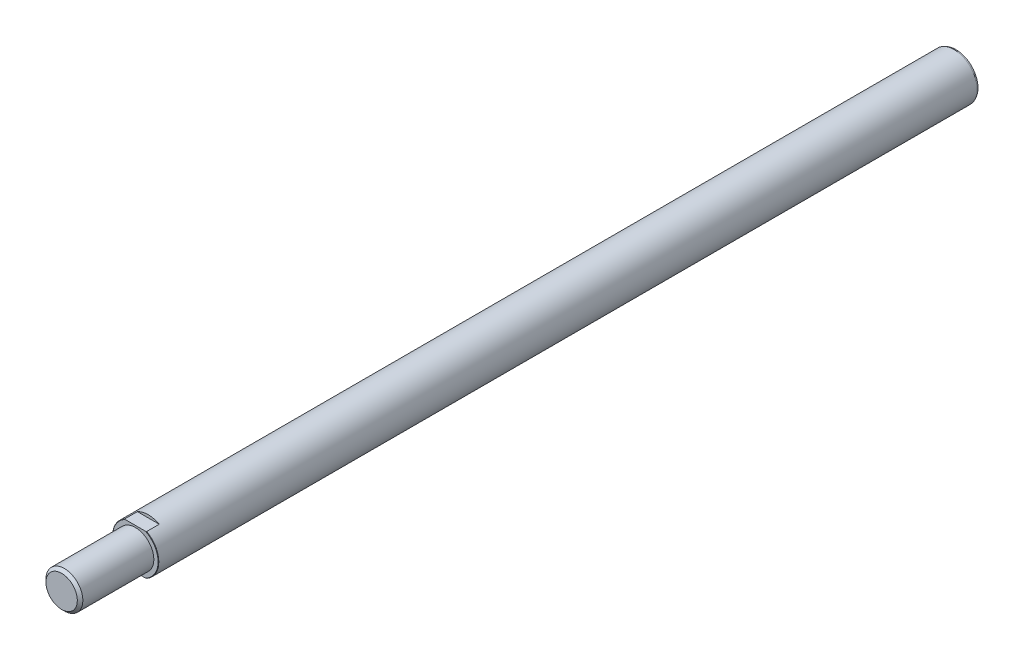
ISO-10303-21;
HEADER;
FILE_DESCRIPTION(('STEP AP214'),'2;1');
FILE_NAME('part.step','',(''),(''),'','','');
FILE_SCHEMA(('AUTOMOTIVE_DESIGN { 1 0 10303 214 1 1 1 1 }'));
ENDSEC;
DATA;
#1=APPLICATION_CONTEXT('core data for automotive mechanical design processes');
#2=APPLICATION_PROTOCOL_DEFINITION('international standard','automotive_design',2000,#1);
#3=PRODUCT_CONTEXT('',#1,'mechanical');
#4=PRODUCT('Part','Part','',(#3));
#5=PRODUCT_RELATED_PRODUCT_CATEGORY('part','',(#4));
#6=PRODUCT_DEFINITION_FORMATION('','',#4);
#7=PRODUCT_DEFINITION_CONTEXT('part definition',#1,'design');
#8=PRODUCT_DEFINITION('design','',#6,#7);
#9=PRODUCT_DEFINITION_SHAPE('','',#8);
#10=(LENGTH_UNIT() NAMED_UNIT(*) SI_UNIT(.MILLI.,.METRE.));
#11=(NAMED_UNIT(*) PLANE_ANGLE_UNIT() SI_UNIT($,.RADIAN.));
#12=(NAMED_UNIT(*) SI_UNIT($,.STERADIAN.) SOLID_ANGLE_UNIT());
#13=UNCERTAINTY_MEASURE_WITH_UNIT(LENGTH_MEASURE(1.E-05),#10,'distance_accuracy_value','');
#14=(GEOMETRIC_REPRESENTATION_CONTEXT(3) GLOBAL_UNCERTAINTY_ASSIGNED_CONTEXT((#13)) GLOBAL_UNIT_ASSIGNED_CONTEXT((#10,
#11,#12)) REPRESENTATION_CONTEXT('',''));
#15=CARTESIAN_POINT('',(0.,0.,0.));
#16=DIRECTION('',(0.,0.,1.));
#17=DIRECTION('',(1.,0.,0.));
#18=AXIS2_PLACEMENT_3D('',#15,#16,#17);
#19=CARTESIAN_POINT('',(0.,0.,485.));
#20=DIRECTION('',(0.,0.,-1.));
#21=DIRECTION('',(-1.,0.,0.));
#22=AXIS2_PLACEMENT_3D('',#19,#20,#21);
#23=CYLINDRICAL_SURFACE('',#22,12.5);
#24=DIRECTION('',(0.,0.,-1.));
#25=VECTOR('',#24,1.);
#26=CARTESIAN_POINT('',(-5.93717104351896,-11.,485.));
#27=LINE('',#26,#25);
#28=CARTESIAN_POINT('',(-5.93717104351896,-11.,444.8));
#29=VERTEX_POINT('',#28);
#30=CARTESIAN_POINT('',(-5.93717104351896,-11.,438.));
#31=VERTEX_POINT('',#30);
#32=EDGE_CURVE('E134',#29,#31,#27,.T.);
#33=ORIENTED_EDGE('',*,*,#32,.F.);
#34=CARTESIAN_POINT('',(0.,0.,444.8));
#35=DIRECTION('',(0.,0.,1.));
#36=DIRECTION('',(1.,0.,0.));
#37=AXIS2_PLACEMENT_3D('',#34,#35,#36);
#38=CIRCLE('',#37,12.5);
#39=CARTESIAN_POINT('',(-5.93717104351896,11.,444.8));
#40=VERTEX_POINT('',#39);
#41=EDGE_CURVE('E146',#29,#40,#38,.F.);
#42=ORIENTED_EDGE('',*,*,#41,.T.);
#43=DIRECTION('',(0.,0.,-1.));
#44=VECTOR('',#43,1.);
#45=CARTESIAN_POINT('',(-5.93717104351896,11.,485.));
#46=LINE('',#45,#44);
#47=CARTESIAN_POINT('',(-5.93717104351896,11.,438.));
#48=VERTEX_POINT('',#47);
#49=EDGE_CURVE('E58',#48,#40,#46,.F.);
#50=ORIENTED_EDGE('',*,*,#49,.F.);
#51=CARTESIAN_POINT('',(0.,0.,438.));
#52=DIRECTION('',(0.,0.,1.));
#53=DIRECTION('',(1.,0.,0.));
#54=AXIS2_PLACEMENT_3D('',#51,#52,#53);
#55=CIRCLE('',#54,12.5);
#56=CARTESIAN_POINT('',(5.93717104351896,11.,438.));
#57=VERTEX_POINT('',#56);
#58=EDGE_CURVE('E329',#57,#48,#55,.T.);
#59=ORIENTED_EDGE('',*,*,#58,.F.);
#60=DIRECTION('',(0.,0.,-1.));
#61=VECTOR('',#60,1.);
#62=CARTESIAN_POINT('',(5.93717104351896,11.,485.));
#63=LINE('',#62,#61);
#64=CARTESIAN_POINT('',(5.93717104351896,11.,444.8));
#65=VERTEX_POINT('',#64);
#66=EDGE_CURVE('E131',#65,#57,#63,.T.);
#67=ORIENTED_EDGE('',*,*,#66,.F.);
#68=CARTESIAN_POINT('',(5.93717104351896,-11.,444.8));
#69=VERTEX_POINT('',#68);
#70=EDGE_CURVE('E143',#65,#69,#38,.F.);
#71=ORIENTED_EDGE('',*,*,#70,.T.);
#72=DIRECTION('',(0.,0.,-1.));
#73=VECTOR('',#72,1.);
#74=CARTESIAN_POINT('',(5.93717104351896,-11.,485.));
#75=LINE('',#74,#73);
#76=CARTESIAN_POINT('',(5.93717104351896,-11.,438.));
#77=VERTEX_POINT('',#76);
#78=EDGE_CURVE('E66',#77,#69,#75,.F.);
#79=ORIENTED_EDGE('',*,*,#78,.F.);
#80=EDGE_CURVE('E332',#31,#77,#55,.T.);
#81=ORIENTED_EDGE('',*,*,#80,.F.);
#82=EDGE_LOOP('',(#33,#42,#50,#59,#67,#71,#79,#81));
#83=FACE_BOUND('',#82,.T.);
#84=CARTESIAN_POINT('',(0.,0.,1.));
#85=DIRECTION('',(0.,0.,-1.));
#86=DIRECTION('',(-1.,0.,0.));
#87=AXIS2_PLACEMENT_3D('',#84,#85,#86);
#88=CIRCLE('',#87,12.5);
#89=CARTESIAN_POINT('',(-12.5,0.,1.));
#90=VERTEX_POINT('',#89);
#91=EDGE_CURVE('E46',#90,#90,#88,.T.);
#92=ORIENTED_EDGE('',*,*,#91,.F.);
#93=EDGE_LOOP('',(#92));
#94=FACE_BOUND('',#93,.T.);
#95=ADVANCED_FACE('F42',(#83,#94),#23,.T.);
#96=CARTESIAN_POINT('',(0.,0.,445.));
#97=DIRECTION('',(0.,0.,1.));
#98=DIRECTION('',(1.,0.,0.));
#99=AXIS2_PLACEMENT_3D('',#96,#97,#98);
#100=PLANE('',#99);
#101=CARTESIAN_POINT('',(0.,0.,445.));
#102=DIRECTION('',(0.,0.,1.));
#103=DIRECTION('',(1.,0.,0.));
#104=AXIS2_PLACEMENT_3D('',#101,#102,#103);
#105=CIRCLE('',#104,10.);
#106=CARTESIAN_POINT('',(10.,0.,445.));
#107=VERTEX_POINT('',#106);
#108=EDGE_CURVE('E136',#107,#107,#105,.T.);
#109=ORIENTED_EDGE('',*,*,#108,.F.);
#110=EDGE_LOOP('',(#109));
#111=FACE_BOUND('',#110,.T.);
#112=CARTESIAN_POINT('',(0.,0.,445.));
#113=DIRECTION('',(0.,0.,1.));
#114=DIRECTION('',(1.,0.,0.));
#115=AXIS2_PLACEMENT_3D('',#112,#113,#114);
#116=CIRCLE('',#115,12.3);
#117=CARTESIAN_POINT('',(-5.50363516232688,11.,445.));
#118=VERTEX_POINT('',#117);
#119=CARTESIAN_POINT('',(-5.50363516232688,-11.,445.));
#120=VERTEX_POINT('',#119);
#121=EDGE_CURVE('E142',#118,#120,#116,.T.);
#122=ORIENTED_EDGE('',*,*,#121,.T.);
#123=DIRECTION('',(1.,0.,0.));
#124=VECTOR('',#123,1.);
#125=CARTESIAN_POINT('',(-18.9676132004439,-11.,445.));
#126=LINE('',#125,#124);
#127=CARTESIAN_POINT('',(5.50363516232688,-11.,445.));
#128=VERTEX_POINT('',#127);
#129=EDGE_CURVE('E123',#120,#128,#126,.T.);
#130=ORIENTED_EDGE('',*,*,#129,.T.);
#131=CARTESIAN_POINT('',(5.50363516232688,11.,445.));
#132=VERTEX_POINT('',#131);
#133=EDGE_CURVE('E139',#128,#132,#116,.T.);
#134=ORIENTED_EDGE('',*,*,#133,.T.);
#135=DIRECTION('',(-1.,0.,0.));
#136=VECTOR('',#135,1.);
#137=CARTESIAN_POINT('',(-18.9676132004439,11.,445.));
#138=LINE('',#137,#136);
#139=EDGE_CURVE('E125',#132,#118,#138,.T.);
#140=ORIENTED_EDGE('',*,*,#139,.T.);
#141=EDGE_LOOP('',(#122,#130,#134,#140));
#142=FACE_BOUND('',#141,.T.);
#143=ADVANCED_FACE('F183',(#111,#142),#100,.T.);
#144=CARTESIAN_POINT('',(0.,0.,445.));
#145=DIRECTION('',(0.,0.,-1.));
#146=DIRECTION('',(-1.,0.,0.));
#147=AXIS2_PLACEMENT_3D('',#144,#145,#146);
#148=CONICAL_SURFACE('',#147,12.3,0.785398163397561);
#149=ORIENTED_EDGE('',*,*,#41,.F.);
#150=CARTESIAN_POINT('',(-25.2049082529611,-11.,429.79932000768));
#151=CARTESIAN_POINT('',(-24.8332961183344,-11.,430.13989947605));
#152=CARTESIAN_POINT('',(-24.4610927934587,-11.,430.479835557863));
#153=CARTESIAN_POINT('',(-23.7153278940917,-11.,431.158220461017));
#154=CARTESIAN_POINT('',(-23.3417663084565,-11.,431.496669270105));
#155=CARTESIAN_POINT('',(-22.5930262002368,-11.,432.1719537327));
#156=CARTESIAN_POINT('',(-22.2178473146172,-11.,432.508788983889));
#157=CARTESIAN_POINT('',(-21.4657494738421,-11.,433.18051046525));
#158=CARTESIAN_POINT('',(-21.0888305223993,-11.,433.515396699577));
#159=CARTESIAN_POINT('',(-20.3305063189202,-11.,434.185120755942));
#160=CARTESIAN_POINT('',(-19.9490878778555,-11.,434.519943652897));
#161=CARTESIAN_POINT('',(-19.1839299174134,-11.,435.186926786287));
#162=CARTESIAN_POINT('',(-18.8001904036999,-11.,435.519087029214));
#163=CARTESIAN_POINT('',(-18.030066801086,-11.,436.180238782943));
#164=CARTESIAN_POINT('',(-17.6436830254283,-11.,436.509230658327));
#165=CARTESIAN_POINT('',(-16.8677829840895,-11.,437.163501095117));
#166=CARTESIAN_POINT('',(-16.478266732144,-11.,437.488779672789));
#167=CARTESIAN_POINT('',(-15.7614675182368,-11.,438.08047512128));
#168=CARTESIAN_POINT('',(-15.4347519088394,-11.,438.347578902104));
#169=CARTESIAN_POINT('',(-14.7783997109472,-11.,438.878171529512));
#170=CARTESIAN_POINT('',(-14.4487631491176,-11.,439.141660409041));
#171=CARTESIAN_POINT('',(-13.7860202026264,-11.,439.664443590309));
#172=CARTESIAN_POINT('',(-13.4529128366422,-11.,439.923736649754));
#173=CARTESIAN_POINT('',(-12.7827870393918,-11.,440.437222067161));
#174=CARTESIAN_POINT('',(-12.4457686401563,-11.,440.691414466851));
#175=CARTESIAN_POINT('',(-11.7675925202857,-11.,441.193346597));
#176=CARTESIAN_POINT('',(-11.4264404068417,-11.,441.441093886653));
#177=CARTESIAN_POINT('',(-10.7388110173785,-11.,441.929138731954));
#178=CARTESIAN_POINT('',(-10.3923335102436,-11.,442.169435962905));
#179=CARTESIAN_POINT('',(-9.69333013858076,-11.,442.640735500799));
#180=CARTESIAN_POINT('',(-9.34080722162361,-11.,442.871742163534));
#181=CARTESIAN_POINT('',(-8.62854944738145,-11.,443.322311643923));
#182=CARTESIAN_POINT('',(-8.26881550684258,-11.,443.541875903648));
#183=CARTESIAN_POINT('',(-7.54622405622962,-11.,443.963558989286));
#184=CARTESIAN_POINT('',(-7.18348838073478,-11.,444.165885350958));
#185=CARTESIAN_POINT('',(-6.44862768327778,-11.,444.552951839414));
#186=CARTESIAN_POINT('',(-6.07650171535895,-11.,444.737690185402));
#187=CARTESIAN_POINT('',(-5.32234700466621,-11.,445.084623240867));
#188=CARTESIAN_POINT('',(-4.94033118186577,-11.,445.246845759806));
#189=CARTESIAN_POINT('',(-4.1654800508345,-11.,445.543160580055));
#190=CARTESIAN_POINT('',(-3.77264786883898,-11.,445.6772609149));
#191=CARTESIAN_POINT('',(-3.05749092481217,-11.,445.887010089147));
#192=CARTESIAN_POINT('',(-2.73703620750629,-11.,445.968998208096));
#193=CARTESIAN_POINT('',(-2.09063675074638,-11.,446.107537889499));
#194=CARTESIAN_POINT('',(-1.76469277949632,-11.,446.164092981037));
#195=CARTESIAN_POINT('',(-1.10994339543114,-11.,446.248894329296));
#196=CARTESIAN_POINT('',(-0.781147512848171,-11.,446.277213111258));
#197=CARTESIAN_POINT('',(-0.122326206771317,-11.,446.304243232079));
#198=CARTESIAN_POINT('',(0.207699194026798,-11.,446.302955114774));
#199=CARTESIAN_POINT('',(0.866187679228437,-11.,446.270850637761));
#200=CARTESIAN_POINT('',(1.19465120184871,-11.,446.240043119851));
#201=CARTESIAN_POINT('',(1.84773423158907,-11.,446.150587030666));
#202=CARTESIAN_POINT('',(2.17235340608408,-11.,446.091936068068));
#203=CARTESIAN_POINT('',(2.81692746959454,-11.,445.949408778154));
#204=CARTESIAN_POINT('',(3.13686596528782,-11.,445.865459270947));
#205=CARTESIAN_POINT('',(3.77013120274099,-11.,445.675776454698));
#206=CARTESIAN_POINT('',(4.08345803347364,-11.,445.570043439));
#207=CARTESIAN_POINT('',(4.77959899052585,-11.,445.311847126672));
#208=CARTESIAN_POINT('',(5.16051287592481,-11.,445.154288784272));
#209=CARTESIAN_POINT('',(5.912172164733,-11.,444.816371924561));
#210=CARTESIAN_POINT('',(6.28291247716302,-11.,444.63600223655));
#211=CARTESIAN_POINT('',(7.01572159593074,-11.,444.256923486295));
#212=CARTESIAN_POINT('',(7.37777248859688,-11.,444.058180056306));
#213=CARTESIAN_POINT('',(8.09354374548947,-11.,443.646436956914));
#214=CARTESIAN_POINT('',(8.44726541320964,-11.,443.433439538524));
#215=CARTESIAN_POINT('',(9.15130038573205,-11.,442.993709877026));
#216=CARTESIAN_POINT('',(9.5015368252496,-11.,442.766855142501));
#217=CARTESIAN_POINT('',(10.1957742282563,-11.,442.303768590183));
#218=CARTESIAN_POINT('',(10.539774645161,-11.,442.067535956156));
#219=CARTESIAN_POINT('',(11.2225281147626,-11.,441.587386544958));
#220=CARTESIAN_POINT('',(11.5612793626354,-11.,441.343467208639));
#221=CARTESIAN_POINT('',(12.23416789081,-11.,440.849383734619));
#222=CARTESIAN_POINT('',(12.5683053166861,-11.,440.59921979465));
#223=CARTESIAN_POINT('',(13.4491244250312,-11.,439.92899361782));
#224=CARTESIAN_POINT('',(13.9924028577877,-11.,439.504460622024));
#225=CARTESIAN_POINT('',(15.0704026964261,-11.,438.644933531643));
#226=CARTESIAN_POINT('',(15.6051257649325,-11.,438.20994151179));
#227=CARTESIAN_POINT('',(16.6682135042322,-11.,437.331532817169));
#228=CARTESIAN_POINT('',(17.1965735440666,-11.,436.888110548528));
#229=CARTESIAN_POINT('',(18.2478896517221,-11.,435.994866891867));
#230=CARTESIAN_POINT('',(18.7708454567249,-11.,435.545045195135));
#231=CARTESIAN_POINT('',(19.7911752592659,-11.,434.658678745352));
#232=CARTESIAN_POINT('',(20.2887256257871,-11.,434.222336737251));
#233=CARTESIAN_POINT('',(21.2804238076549,-11.,433.34582102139));
#234=CARTESIAN_POINT('',(21.7745716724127,-11.,432.905647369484));
#235=CARTESIAN_POINT('',(22.7594616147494,-11.,432.02262907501));
#236=CARTESIAN_POINT('',(23.2502069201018,-11.,431.579788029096));
#237=CARTESIAN_POINT('',(24.229272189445,-11.,430.6914346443));
#238=CARTESIAN_POINT('',(24.7175921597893,-11.,430.245922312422));
#239=CARTESIAN_POINT('',(25.2049082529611,-11.,429.79932000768));
#240=B_SPLINE_CURVE_WITH_KNOTS('',3,(#150,#151,#152,#153,#154,#155,#156,#157,#158,#159,#160,
#161,#162,#163,#164,#165,#166,#167,#168,#169,#170,#171,#172,#173,#174,#175,#176,#177,#178,#179,
#180,#181,#182,#183,#184,#185,#186,#187,#188,#189,#190,#191,#192,#193,#194,#195,#196,#197,#198,
#199,#200,#201,#202,#203,#204,#205,#206,#207,#208,#209,#210,#211,#212,#213,#214,#215,#216,#217,
#218,#219,#220,#221,#222,#223,#224,#225,#226,#227,#228,#229,#230,#231,#232,#233,#234,#235,#236,
#237,#238,#239),.UNSPECIFIED.,.F.,.F.,(4,2,2,2,2,2,2,2,2,2,2,2,2,2,2,2,2,2,2,2,2,2,2,2,2,2,2,2,
2,2,2,2,2,2,2,2,2,2,2,2,2,2,2,2,4),(0.,1.51222100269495,3.02445444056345,4.53704712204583,
6.04963657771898,7.57221518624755,9.09479008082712,10.617187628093,12.1395785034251,
13.4055696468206,14.671549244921,15.9378970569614,17.2042345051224,18.4690128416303,
19.7338462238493,20.9980795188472,22.2621530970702,23.5078130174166,24.7535989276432,
25.9978321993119,27.2417095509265,28.2331520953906,29.2244570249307,30.2132091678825,
31.2019431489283,32.190381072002,33.1789039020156,34.1703140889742,35.1617109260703,
36.3973752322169,37.6336470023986,38.8722798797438,40.1107176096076,41.36239513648,
42.6141818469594,43.8663898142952,45.1185581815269,47.186797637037,49.2546301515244,
51.3238862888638,53.3932425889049,55.3785544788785,57.3638374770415,59.3468682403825,
61.3298938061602),.UNSPECIFIED.);
#241=EDGE_CURVE('E325',#29,#120,#240,.T.);
#242=ORIENTED_EDGE('',*,*,#241,.T.);
#243=ORIENTED_EDGE('',*,*,#121,.F.);
#244=CARTESIAN_POINT('',(25.2049082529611,11.,429.79932000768));
#245=CARTESIAN_POINT('',(24.8332961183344,11.,430.13989947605));
#246=CARTESIAN_POINT('',(24.4610927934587,11.,430.479835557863));
#247=CARTESIAN_POINT('',(23.7153278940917,11.,431.158220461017));
#248=CARTESIAN_POINT('',(23.3417663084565,11.,431.496669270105));
#249=CARTESIAN_POINT('',(22.5930262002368,11.,432.1719537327));
#250=CARTESIAN_POINT('',(22.2178473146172,11.,432.508788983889));
#251=CARTESIAN_POINT('',(21.4657494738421,11.,433.18051046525));
#252=CARTESIAN_POINT('',(21.0888305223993,11.,433.515396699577));
#253=CARTESIAN_POINT('',(20.3305063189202,11.,434.185120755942));
#254=CARTESIAN_POINT('',(19.9490878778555,11.,434.519943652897));
#255=CARTESIAN_POINT('',(19.1839299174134,11.,435.186926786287));
#256=CARTESIAN_POINT('',(18.8001904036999,11.,435.519087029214));
#257=CARTESIAN_POINT('',(18.030066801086,11.,436.180238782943));
#258=CARTESIAN_POINT('',(17.6436830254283,11.,436.509230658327));
#259=CARTESIAN_POINT('',(16.8677829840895,11.,437.163501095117));
#260=CARTESIAN_POINT('',(16.478266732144,11.,437.488779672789));
#261=CARTESIAN_POINT('',(15.7614675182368,11.,438.08047512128));
#262=CARTESIAN_POINT('',(15.4347519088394,11.,438.347578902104));
#263=CARTESIAN_POINT('',(14.7783997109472,11.,438.878171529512));
#264=CARTESIAN_POINT('',(14.4487631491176,11.,439.141660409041));
#265=CARTESIAN_POINT('',(13.7860202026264,11.,439.664443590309));
#266=CARTESIAN_POINT('',(13.4529128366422,11.,439.923736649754));
#267=CARTESIAN_POINT('',(12.7827870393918,11.,440.437222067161));
#268=CARTESIAN_POINT('',(12.4457686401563,11.,440.691414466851));
#269=CARTESIAN_POINT('',(11.7675925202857,11.,441.193346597));
#270=CARTESIAN_POINT('',(11.4264404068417,11.,441.441093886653));
#271=CARTESIAN_POINT('',(10.7388110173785,11.,441.929138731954));
#272=CARTESIAN_POINT('',(10.3923335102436,11.,442.169435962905));
#273=CARTESIAN_POINT('',(9.69333013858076,11.,442.640735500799));
#274=CARTESIAN_POINT('',(9.34080722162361,11.,442.871742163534));
#275=CARTESIAN_POINT('',(8.62854944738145,11.,443.322311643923));
#276=CARTESIAN_POINT('',(8.26881550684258,11.,443.541875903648));
#277=CARTESIAN_POINT('',(7.54622405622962,11.,443.963558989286));
#278=CARTESIAN_POINT('',(7.18348838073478,11.,444.165885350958));
#279=CARTESIAN_POINT('',(6.44862768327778,11.,444.552951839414));
#280=CARTESIAN_POINT('',(6.07650171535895,11.,444.737690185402));
#281=CARTESIAN_POINT('',(5.32234700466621,11.,445.084623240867));
#282=CARTESIAN_POINT('',(4.94033118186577,11.,445.246845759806));
#283=CARTESIAN_POINT('',(4.1654800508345,11.,445.543160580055));
#284=CARTESIAN_POINT('',(3.77264786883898,11.,445.6772609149));
#285=CARTESIAN_POINT('',(3.05749092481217,11.,445.887010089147));
#286=CARTESIAN_POINT('',(2.73703620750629,11.,445.968998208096));
#287=CARTESIAN_POINT('',(2.09063675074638,11.,446.107537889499));
#288=CARTESIAN_POINT('',(1.76469277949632,11.,446.164092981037));
#289=CARTESIAN_POINT('',(1.10994339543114,11.,446.248894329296));
#290=CARTESIAN_POINT('',(0.781147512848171,11.,446.277213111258));
#291=CARTESIAN_POINT('',(0.122326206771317,11.,446.304243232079));
#292=CARTESIAN_POINT('',(-0.207699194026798,11.,446.302955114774));
#293=CARTESIAN_POINT('',(-0.866187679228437,11.,446.270850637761));
#294=CARTESIAN_POINT('',(-1.19465120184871,11.,446.240043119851));
#295=CARTESIAN_POINT('',(-1.84773423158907,11.,446.150587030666));
#296=CARTESIAN_POINT('',(-2.17235340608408,11.,446.091936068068));
#297=CARTESIAN_POINT('',(-2.81692746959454,11.,445.949408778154));
#298=CARTESIAN_POINT('',(-3.13686596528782,11.,445.865459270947));
#299=CARTESIAN_POINT('',(-3.77013120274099,11.,445.675776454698));
#300=CARTESIAN_POINT('',(-4.08345803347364,11.,445.570043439));
#301=CARTESIAN_POINT('',(-4.77959899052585,11.,445.311847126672));
#302=CARTESIAN_POINT('',(-5.16051287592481,11.,445.154288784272));
#303=CARTESIAN_POINT('',(-5.912172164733,11.,444.816371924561));
#304=CARTESIAN_POINT('',(-6.28291247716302,11.,444.63600223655));
#305=CARTESIAN_POINT('',(-7.01572159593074,11.,444.256923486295));
#306=CARTESIAN_POINT('',(-7.37777248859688,11.,444.058180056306));
#307=CARTESIAN_POINT('',(-8.09354374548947,11.,443.646436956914));
#308=CARTESIAN_POINT('',(-8.44726541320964,11.,443.433439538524));
#309=CARTESIAN_POINT('',(-9.15130038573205,11.,442.993709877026));
#310=CARTESIAN_POINT('',(-9.5015368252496,11.,442.766855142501));
#311=CARTESIAN_POINT('',(-10.1957742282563,11.,442.303768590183));
#312=CARTESIAN_POINT('',(-10.539774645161,11.,442.067535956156));
#313=CARTESIAN_POINT('',(-11.2225281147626,11.,441.587386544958));
#314=CARTESIAN_POINT('',(-11.5612793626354,11.,441.343467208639));
#315=CARTESIAN_POINT('',(-12.23416789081,11.,440.849383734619));
#316=CARTESIAN_POINT('',(-12.5683053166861,11.,440.59921979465));
#317=CARTESIAN_POINT('',(-13.4491244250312,11.,439.92899361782));
#318=CARTESIAN_POINT('',(-13.9924028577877,11.,439.504460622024));
#319=CARTESIAN_POINT('',(-15.0704026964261,11.,438.644933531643));
#320=CARTESIAN_POINT('',(-15.6051257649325,11.,438.20994151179));
#321=CARTESIAN_POINT('',(-16.6682135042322,11.,437.331532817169));
#322=CARTESIAN_POINT('',(-17.1965735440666,11.,436.888110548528));
#323=CARTESIAN_POINT('',(-18.2478896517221,11.,435.994866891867));
#324=CARTESIAN_POINT('',(-18.7708454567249,11.,435.545045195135));
#325=CARTESIAN_POINT('',(-19.7911752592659,11.,434.658678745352));
#326=CARTESIAN_POINT('',(-20.2887256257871,11.,434.222336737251));
#327=CARTESIAN_POINT('',(-21.2804238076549,11.,433.34582102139));
#328=CARTESIAN_POINT('',(-21.7745716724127,11.,432.905647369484));
#329=CARTESIAN_POINT('',(-22.7594616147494,11.,432.02262907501));
#330=CARTESIAN_POINT('',(-23.2502069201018,11.,431.579788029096));
#331=CARTESIAN_POINT('',(-24.229272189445,11.,430.6914346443));
#332=CARTESIAN_POINT('',(-24.7175921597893,11.,430.245922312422));
#333=CARTESIAN_POINT('',(-25.2049082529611,11.,429.79932000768));
#334=B_SPLINE_CURVE_WITH_KNOTS('',3,(#244,#245,#246,#247,#248,#249,#250,#251,#252,#253,#254,
#255,#256,#257,#258,#259,#260,#261,#262,#263,#264,#265,#266,#267,#268,#269,#270,#271,#272,#273,
#274,#275,#276,#277,#278,#279,#280,#281,#282,#283,#284,#285,#286,#287,#288,#289,#290,#291,#292,
#293,#294,#295,#296,#297,#298,#299,#300,#301,#302,#303,#304,#305,#306,#307,#308,#309,#310,#311,
#312,#313,#314,#315,#316,#317,#318,#319,#320,#321,#322,#323,#324,#325,#326,#327,#328,#329,#330,
#331,#332,#333),.UNSPECIFIED.,.F.,.F.,(4,2,2,2,2,2,2,2,2,2,2,2,2,2,2,2,2,2,2,2,2,2,2,2,2,2,2,2,
2,2,2,2,2,2,2,2,2,2,2,2,2,2,2,2,4),(0.,1.51222100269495,3.02445444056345,4.53704712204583,
6.04963657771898,7.57221518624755,9.09479008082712,10.617187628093,12.1395785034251,
13.4055696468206,14.671549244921,15.9378970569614,17.2042345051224,18.4690128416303,
19.7338462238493,20.9980795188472,22.2621530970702,23.5078130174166,24.7535989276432,
25.9978321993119,27.2417095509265,28.2331520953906,29.2244570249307,30.2132091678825,
31.2019431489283,32.190381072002,33.1789039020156,34.1703140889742,35.1617109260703,
36.3973752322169,37.6336470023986,38.8722798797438,40.1107176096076,41.36239513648,
42.6141818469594,43.8663898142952,45.1185581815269,47.186797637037,49.2546301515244,
51.3238862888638,53.3932425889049,55.3785544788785,57.3638374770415,59.3468682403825,
61.3298938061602),.UNSPECIFIED.);
#335=EDGE_CURVE('E147',#118,#40,#334,.T.);
#336=ORIENTED_EDGE('',*,*,#335,.T.);
#337=EDGE_LOOP('',(#149,#242,#243,#336));
#338=FACE_BOUND('',#337,.T.);
#339=ADVANCED_FACE('F162',(#338),#148,.T.);
#340=ORIENTED_EDGE('',*,*,#133,.F.);
#341=EDGE_CURVE('E155',#128,#69,#240,.T.);
#342=ORIENTED_EDGE('',*,*,#341,.T.);
#343=ORIENTED_EDGE('',*,*,#70,.F.);
#344=EDGE_CURVE('E154',#65,#132,#334,.T.);
#345=ORIENTED_EDGE('',*,*,#344,.T.);
#346=EDGE_LOOP('',(#340,#342,#343,#345));
#347=FACE_BOUND('',#346,.T.);
#348=ADVANCED_FACE('F181',(#347),#148,.T.);
#349=CARTESIAN_POINT('',(0.,0.,445.));
#350=DIRECTION('',(0.,0.,1.));
#351=DIRECTION('',(1.,0.,0.));
#352=AXIS2_PLACEMENT_3D('',#349,#350,#351);
#353=CYLINDRICAL_SURFACE('',#352,10.);
#354=CARTESIAN_POINT('',(0.,0.,483.5));
#355=DIRECTION('',(0.,0.,1.));
#356=DIRECTION('',(1.,0.,0.));
#357=AXIS2_PLACEMENT_3D('',#354,#355,#356);
#358=CIRCLE('',#357,10.);
#359=CARTESIAN_POINT('',(10.,0.,483.5));
#360=VERTEX_POINT('',#359);
#361=EDGE_CURVE('E12',#360,#360,#358,.F.);
#362=ORIENTED_EDGE('',*,*,#361,.T.);
#363=EDGE_LOOP('',(#362));
#364=FACE_BOUND('',#363,.T.);
#365=ORIENTED_EDGE('',*,*,#108,.T.);
#366=EDGE_LOOP('',(#365));
#367=FACE_BOUND('',#366,.T.);
#368=ADVANCED_FACE('F178',(#364,#367),#353,.T.);
#369=CARTESIAN_POINT('',(0.,0.,485.));
#370=DIRECTION('',(0.,0.,1.));
#371=DIRECTION('',(1.,0.,0.));
#372=AXIS2_PLACEMENT_3D('',#369,#370,#371);
#373=PLANE('',#372);
#374=CARTESIAN_POINT('',(0.,0.,485.));
#375=DIRECTION('',(0.,0.,1.));
#376=DIRECTION('',(1.,0.,0.));
#377=AXIS2_PLACEMENT_3D('',#374,#375,#376);
#378=CIRCLE('',#377,8.50000000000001);
#379=CARTESIAN_POINT('',(8.50000000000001,0.,485.));
#380=VERTEX_POINT('',#379);
#381=EDGE_CURVE('E51',#380,#380,#378,.T.);
#382=ORIENTED_EDGE('',*,*,#381,.T.);
#383=EDGE_LOOP('',(#382));
#384=FACE_BOUND('',#383,.T.);
#385=ADVANCED_FACE('F170',(#384),#373,.T.);
#386=CARTESIAN_POINT('',(-18.9676132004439,11.,438.));
#387=DIRECTION('',(0.,1.,0.));
#388=DIRECTION('',(0.,0.,1.));
#389=AXIS2_PLACEMENT_3D('',#386,#387,#388);
#390=PLANE('',#389);
#391=ORIENTED_EDGE('',*,*,#66,.T.);
#392=DIRECTION('',(-1.,0.,0.));
#393=VECTOR('',#392,1.);
#394=CARTESIAN_POINT('',(-18.9676132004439,11.,438.));
#395=LINE('',#394,#393);
#396=EDGE_CURVE('E120',#57,#48,#395,.T.);
#397=ORIENTED_EDGE('',*,*,#396,.T.);
#398=ORIENTED_EDGE('',*,*,#49,.T.);
#399=ORIENTED_EDGE('',*,*,#335,.F.);
#400=ORIENTED_EDGE('',*,*,#139,.F.);
#401=ORIENTED_EDGE('',*,*,#344,.F.);
#402=EDGE_LOOP('',(#391,#397,#398,#399,#400,#401));
#403=FACE_BOUND('',#402,.T.);
#404=ADVANCED_FACE('F165',(#403),#390,.T.);
#405=CARTESIAN_POINT('',(0.,0.,438.));
#406=DIRECTION('',(0.,0.,1.));
#407=DIRECTION('',(1.,0.,0.));
#408=AXIS2_PLACEMENT_3D('',#405,#406,#407);
#409=PLANE('',#408);
#410=ORIENTED_EDGE('',*,*,#58,.T.);
#411=ORIENTED_EDGE('',*,*,#396,.F.);
#412=EDGE_LOOP('',(#410,#411));
#413=FACE_BOUND('',#412,.T.);
#414=ADVANCED_FACE('F169',(#413),#409,.T.);
#415=ORIENTED_EDGE('',*,*,#80,.T.);
#416=DIRECTION('',(1.,0.,0.));
#417=VECTOR('',#416,1.);
#418=CARTESIAN_POINT('',(-18.9676132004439,-11.,438.));
#419=LINE('',#418,#417);
#420=EDGE_CURVE('E122',#31,#77,#419,.T.);
#421=ORIENTED_EDGE('',*,*,#420,.F.);
#422=EDGE_LOOP('',(#415,#421));
#423=FACE_BOUND('',#422,.T.);
#424=ADVANCED_FACE('F176',(#423),#409,.T.);
#425=CARTESIAN_POINT('',(-18.9676132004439,-11.,438.));
#426=DIRECTION('',(0.,-1.,0.));
#427=DIRECTION('',(0.,0.,-1.));
#428=AXIS2_PLACEMENT_3D('',#425,#426,#427);
#429=PLANE('',#428);
#430=ORIENTED_EDGE('',*,*,#32,.T.);
#431=ORIENTED_EDGE('',*,*,#420,.T.);
#432=ORIENTED_EDGE('',*,*,#78,.T.);
#433=ORIENTED_EDGE('',*,*,#341,.F.);
#434=ORIENTED_EDGE('',*,*,#129,.F.);
#435=ORIENTED_EDGE('',*,*,#241,.F.);
#436=EDGE_LOOP('',(#430,#431,#432,#433,#434,#435));
#437=FACE_BOUND('',#436,.T.);
#438=ADVANCED_FACE('F171',(#437),#429,.T.);
#439=CARTESIAN_POINT('',(0.,0.,485.));
#440=DIRECTION('',(0.,0.,-1.));
#441=DIRECTION('',(-1.,0.,0.));
#442=AXIS2_PLACEMENT_3D('',#439,#440,#441);
#443=CONICAL_SURFACE('',#442,8.50000000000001,0.785398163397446);
#444=ORIENTED_EDGE('',*,*,#361,.F.);
#445=EDGE_LOOP('',(#444));
#446=FACE_BOUND('',#445,.T.);
#447=ORIENTED_EDGE('',*,*,#381,.F.);
#448=EDGE_LOOP('',(#447));
#449=FACE_BOUND('',#448,.T.);
#450=ADVANCED_FACE('F44',(#446,#449),#443,.T.);
#451=CARTESIAN_POINT('',(0.,0.,1.));
#452=DIRECTION('',(0.,0.,-1.));
#453=DIRECTION('',(-1.,0.,0.));
#454=AXIS2_PLACEMENT_3D('',#451,#452,#453);
#455=PLANE('',#454);
#456=CARTESIAN_POINT('',(0.,0.,1.));
#457=DIRECTION('',(0.,0.,-1.));
#458=DIRECTION('',(-1.,0.,0.));
#459=AXIS2_PLACEMENT_3D('',#456,#457,#458);
#460=CIRCLE('',#459,12.);
#461=CARTESIAN_POINT('',(-12.,0.,1.));
#462=VERTEX_POINT('',#461);
#463=EDGE_CURVE('E113',#462,#462,#460,.T.);
#464=ORIENTED_EDGE('',*,*,#463,.F.);
#465=EDGE_LOOP('',(#464));
#466=FACE_BOUND('',#465,.T.);
#467=ORIENTED_EDGE('',*,*,#91,.T.);
#468=EDGE_LOOP('',(#467));
#469=FACE_BOUND('',#468,.T.);
#470=ADVANCED_FACE('F205',(#466,#469),#455,.T.);
#471=CARTESIAN_POINT('',(0.,0.,1.));
#472=DIRECTION('',(0.,0.,-1.));
#473=DIRECTION('',(-1.,0.,0.));
#474=AXIS2_PLACEMENT_3D('',#471,#472,#473);
#475=CYLINDRICAL_SURFACE('',#474,12.);
#476=ORIENTED_EDGE('',*,*,#463,.T.);
#477=EDGE_LOOP('',(#476));
#478=FACE_BOUND('',#477,.T.);
#479=CARTESIAN_POINT('',(0.,0.,0.));
#480=DIRECTION('',(0.,0.,-1.));
#481=DIRECTION('',(-1.,0.,0.));
#482=AXIS2_PLACEMENT_3D('',#479,#480,#481);
#483=CIRCLE('',#482,12.);
#484=CARTESIAN_POINT('',(-12.,0.,0.));
#485=VERTEX_POINT('',#484);
#486=EDGE_CURVE('E109',#485,#485,#483,.T.);
#487=ORIENTED_EDGE('',*,*,#486,.F.);
#488=EDGE_LOOP('',(#487));
#489=FACE_BOUND('',#488,.T.);
#490=ADVANCED_FACE('F191',(#478,#489),#475,.T.);
#491=CARTESIAN_POINT('',(0.,0.,0.));
#492=DIRECTION('',(0.,0.,1.));
#493=DIRECTION('',(1.,0.,0.));
#494=AXIS2_PLACEMENT_3D('',#491,#492,#493);
#495=PLANE('',#494);
#496=CARTESIAN_POINT('',(0.,0.,0.));
#497=DIRECTION('',(0.,0.,-1.));
#498=DIRECTION('',(-1.,0.,0.));
#499=AXIS2_PLACEMENT_3D('',#496,#497,#498);
#500=CIRCLE('',#499,5.1);
#501=CARTESIAN_POINT('',(-5.1,0.,0.));
#502=VERTEX_POINT('',#501);
#503=EDGE_CURVE('E110',#502,#502,#500,.T.);
#504=ORIENTED_EDGE('',*,*,#503,.F.);
#505=EDGE_LOOP('',(#504));
#506=FACE_BOUND('',#505,.T.);
#507=ORIENTED_EDGE('',*,*,#486,.T.);
#508=EDGE_LOOP('',(#507));
#509=FACE_BOUND('',#508,.T.);
#510=ADVANCED_FACE('F103',(#506,#509),#495,.F.);
#511=CARTESIAN_POINT('',(0.,0.,32.75));
#512=DIRECTION('',(0.,0.,-1.));
#513=DIRECTION('',(-1.,0.,0.));
#514=AXIS2_PLACEMENT_3D('',#511,#512,#513);
#515=CONICAL_SURFACE('',#514,5.09999999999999,1.02974425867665);
#516=CARTESIAN_POINT('',(0.,0.,35.8143891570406));
#517=VERTEX_POINT('',#516);
#518=VERTEX_LOOP('',#517);
#519=FACE_BOUND('',#518,.T.);
#520=CARTESIAN_POINT('',(0.,0.,32.75));
#521=DIRECTION('',(0.,0.,-1.));
#522=DIRECTION('',(-1.,0.,0.));
#523=AXIS2_PLACEMENT_3D('',#520,#521,#522);
#524=CIRCLE('',#523,5.09999999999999);
#525=CARTESIAN_POINT('',(-5.09999999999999,0.,32.75));
#526=VERTEX_POINT('',#525);
#527=EDGE_CURVE('E107',#526,#526,#524,.T.);
#528=ORIENTED_EDGE('',*,*,#527,.T.);
#529=EDGE_LOOP('',(#528));
#530=FACE_BOUND('',#529,.T.);
#531=ADVANCED_FACE('F99',(#519,#530),#515,.F.);
#532=CARTESIAN_POINT('',(0.,0.,0.));
#533=DIRECTION('',(0.,0.,-1.));
#534=DIRECTION('',(-1.,0.,0.));
#535=AXIS2_PLACEMENT_3D('',#532,#533,#534);
#536=CYLINDRICAL_SURFACE('',#535,5.09999999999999);
#537=ORIENTED_EDGE('',*,*,#527,.F.);
#538=EDGE_LOOP('',(#537));
#539=FACE_BOUND('',#538,.T.);
#540=ORIENTED_EDGE('',*,*,#503,.T.);
#541=EDGE_LOOP('',(#540));
#542=FACE_BOUND('',#541,.T.);
#543=ADVANCED_FACE('F102',(#539,#542),#536,.F.);
#544=CLOSED_SHELL('',(#95,#143,#339,#348,#368,#385,#404,#414,#424,#438,#450,#470,#490,#510,#531,#543));
#545=MANIFOLD_SOLID_BREP('B2',#544);
#546=ADVANCED_BREP_SHAPE_REPRESENTATION('',(#18,#545),#14);
#547=SHAPE_DEFINITION_REPRESENTATION(#9,#546);
ENDSEC;
END-ISO-10303-21;
